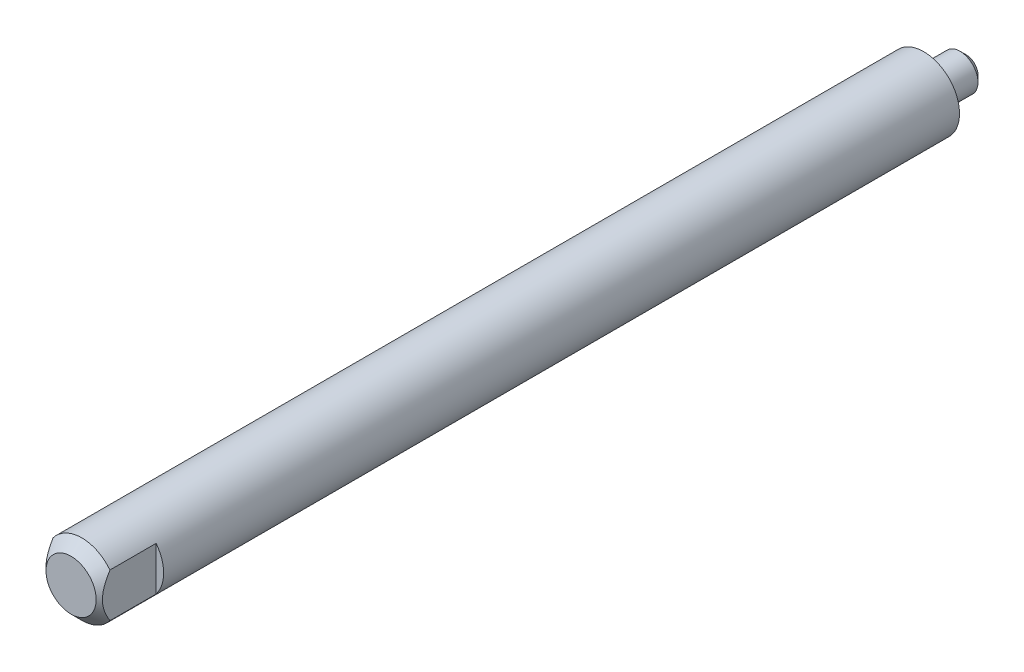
ISO-10303-21;
HEADER;
FILE_DESCRIPTION(('STEP AP214'),'2;1');
FILE_NAME('part.step','',(''),(''),'','','');
FILE_SCHEMA(('AUTOMOTIVE_DESIGN { 1 0 10303 214 1 1 1 1 }'));
ENDSEC;
DATA;
#1=APPLICATION_CONTEXT('core data for automotive mechanical design processes');
#2=APPLICATION_PROTOCOL_DEFINITION('international standard','automotive_design',2000,#1);
#3=PRODUCT_CONTEXT('',#1,'mechanical');
#4=PRODUCT('Part','Part','',(#3));
#5=PRODUCT_RELATED_PRODUCT_CATEGORY('part','',(#4));
#6=PRODUCT_DEFINITION_FORMATION('','',#4);
#7=PRODUCT_DEFINITION_CONTEXT('part definition',#1,'design');
#8=PRODUCT_DEFINITION('design','',#6,#7);
#9=PRODUCT_DEFINITION_SHAPE('','',#8);
#10=(LENGTH_UNIT() NAMED_UNIT(*) SI_UNIT(.MILLI.,.METRE.));
#11=(NAMED_UNIT(*) PLANE_ANGLE_UNIT() SI_UNIT($,.RADIAN.));
#12=(NAMED_UNIT(*) SI_UNIT($,.STERADIAN.) SOLID_ANGLE_UNIT());
#13=UNCERTAINTY_MEASURE_WITH_UNIT(LENGTH_MEASURE(1.E-05),#10,'distance_accuracy_value','');
#14=(GEOMETRIC_REPRESENTATION_CONTEXT(3) GLOBAL_UNCERTAINTY_ASSIGNED_CONTEXT((#13)) GLOBAL_UNIT_ASSIGNED_CONTEXT((#10,
#11,#12)) REPRESENTATION_CONTEXT('',''));
#15=CARTESIAN_POINT('',(0.,0.,0.));
#16=DIRECTION('',(0.,0.,1.));
#17=DIRECTION('',(1.,0.,0.));
#18=AXIS2_PLACEMENT_3D('',#15,#16,#17);
#19=CARTESIAN_POINT('',(0.0303893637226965,0.,120.));
#20=DIRECTION('',(0.,0.,-1.));
#21=DIRECTION('',(0.,-1.,0.));
#22=AXIS2_PLACEMENT_3D('',#19,#20,#21);
#23=CONICAL_SURFACE('',#22,3.5303893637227,0.78539816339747);
#24=CARTESIAN_POINT('',(0.0303893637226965,0.,120.));
#25=DIRECTION('',(0.,0.,-1.));
#26=DIRECTION('',(0.,-1.,0.));
#27=AXIS2_PLACEMENT_3D('',#24,#25,#26);
#28=CIRCLE('',#27,3.5303893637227);
#29=CARTESIAN_POINT('',(0.0303893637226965,-3.5303893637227,120.));
#30=VERTEX_POINT('',#29);
#31=EDGE_CURVE('E112',#30,#30,#28,.T.);
#32=ORIENTED_EDGE('',*,*,#31,.T.);
#33=EDGE_LOOP('',(#32));
#34=FACE_BOUND('',#33,.T.);
#35=CARTESIAN_POINT('',(4.,7.33813034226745,115.187370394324));
#36=CARTESIAN_POINT('',(4.,7.16528585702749,115.339369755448));
#37=CARTESIAN_POINT('',(4.,6.99186027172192,115.490715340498));
#38=CARTESIAN_POINT('',(4.,6.64353602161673,115.791747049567));
#39=CARTESIAN_POINT('',(4.,6.46863716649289,115.94143295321));
#40=CARTESIAN_POINT('',(4.,6.11613508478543,116.239570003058));
#41=CARTESIAN_POINT('',(4.,5.93852227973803,116.388009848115));
#42=CARTESIAN_POINT('',(4.,5.5811516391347,116.682267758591));
#43=CARTESIAN_POINT('',(4.,5.40139393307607,116.82808598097));
#44=CARTESIAN_POINT('',(4.,5.02624820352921,117.126705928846));
#45=CARTESIAN_POINT('',(4.,4.83066252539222,117.279260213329));
#46=CARTESIAN_POINT('',(4.,4.4355616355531,117.579299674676));
#47=CARTESIAN_POINT('',(4.,4.23604568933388,117.726783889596));
#48=CARTESIAN_POINT('',(4.,3.83248423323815,118.014436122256));
#49=CARTESIAN_POINT('',(4.,3.62845042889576,118.15462046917));
#50=CARTESIAN_POINT('',(4.,3.21402508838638,118.425189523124));
#51=CARTESIAN_POINT('',(4.,3.00363658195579,118.555578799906));
#52=CARTESIAN_POINT('',(4.,2.64334730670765,118.762693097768));
#53=CARTESIAN_POINT('',(4.,2.4956507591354,118.843232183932));
#54=CARTESIAN_POINT('',(4.,2.19580765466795,118.995777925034));
#55=CARTESIAN_POINT('',(4.,2.04365981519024,119.067782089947));
#56=CARTESIAN_POINT('',(4.,1.73620810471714,119.199895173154));
#57=CARTESIAN_POINT('',(4.,1.58095751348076,119.2601264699));
#58=CARTESIAN_POINT('',(4.,1.26569016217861,119.366517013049));
#59=CARTESIAN_POINT('',(4.,1.10567636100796,119.412684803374));
#60=CARTESIAN_POINT('',(4.,0.827710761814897,119.476973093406));
#61=CARTESIAN_POINT('',(4.,0.710741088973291,119.499336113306));
#62=CARTESIAN_POINT('',(4.,0.475325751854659,119.534114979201));
#63=CARTESIAN_POINT('',(4.,0.356880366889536,119.546532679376));
#64=CARTESIAN_POINT('',(4.,0.119558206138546,119.5607419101));
#65=CARTESIAN_POINT('',(4.,0.000682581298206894,119.562552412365));
#66=CARTESIAN_POINT('',(4.,-0.236754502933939,119.55549603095));
#67=CARTESIAN_POINT('',(4.,-0.35531594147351,119.546628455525));
#68=CARTESIAN_POINT('',(4.,-0.590194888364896,119.518825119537));
#69=CARTESIAN_POINT('',(4.,-0.706522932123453,119.499976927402));
#70=CARTESIAN_POINT('',(4.,-0.937319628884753,119.453184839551));
#71=CARTESIAN_POINT('',(4.,-1.05178812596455,119.425240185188));
#72=CARTESIAN_POINT('',(4.,-1.27960221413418,119.361083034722));
#73=CARTESIAN_POINT('',(4.,-1.39292493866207,119.32479022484));
#74=CARTESIAN_POINT('',(4.,-1.61707609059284,119.245326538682));
#75=CARTESIAN_POINT('',(4.,-1.727905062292,119.202157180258));
#76=CARTESIAN_POINT('',(4.,-2.01082785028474,119.083315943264));
#77=CARTESIAN_POINT('',(4.,-2.18110670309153,119.003331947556));
#78=CARTESIAN_POINT('',(4.,-2.51626466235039,118.832668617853));
#79=CARTESIAN_POINT('',(4.,-2.68113979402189,118.741981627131));
#80=CARTESIAN_POINT('',(4.,-3.00688630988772,118.552279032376));
#81=CARTESIAN_POINT('',(4.,-3.16773873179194,118.453231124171));
#82=CARTESIAN_POINT('',(4.,-3.48549889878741,118.24913047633));
#83=CARTESIAN_POINT('',(4.,-3.64240766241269,118.144079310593));
#84=CARTESIAN_POINT('',(4.,-3.94420672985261,117.935446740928));
#85=CARTESIAN_POINT('',(4.,-4.08927393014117,117.832119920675));
#86=CARTESIAN_POINT('',(4.,-4.3770427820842,117.622205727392));
#87=CARTESIAN_POINT('',(4.,-4.51974421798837,117.515618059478));
#88=CARTESIAN_POINT('',(4.,-4.80180621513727,117.300874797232));
#89=CARTESIAN_POINT('',(4.,-4.94118567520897,117.192743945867));
#90=CARTESIAN_POINT('',(4.,-5.21825792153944,116.974411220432));
#91=CARTESIAN_POINT('',(4.,-5.35595112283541,116.864209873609));
#92=CARTESIAN_POINT('',(4.,-5.49296670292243,116.753185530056));
#93=B_SPLINE_CURVE_WITH_KNOTS('',3,(#35,#36,#37,#38,#39,#40,#41,#42,#43,#44,#45,#46,#47,#48,#49,
#50,#51,#52,#53,#54,#55,#56,#57,#58,#59,#60,#61,#62,#63,#64,#65,#66,#67,#68,#69,#70,#71,#72,#73,
#74,#75,#76,#77,#78,#79,#80,#81,#82,#83,#84,#85,#86,#87,#88,#89,#90,#91,#92),.UNSPECIFIED.,.F.,
.F.,(4,2,2,2,2,2,2,2,2,2,2,2,2,2,2,2,2,2,2,2,2,2,2,2,2,2,2,2,4),(0.,0.690520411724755,
1.38113143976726,2.0755365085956,2.76989986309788,3.51397533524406,4.25819121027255,
5.00066372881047,5.74278767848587,6.24726681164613,6.75189276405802,7.25095592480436,
7.74971528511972,8.10660603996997,8.46343024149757,8.8196160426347,9.17582491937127,
9.52895903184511,9.88212260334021,10.2388375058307,10.5954737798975,11.1593067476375,
11.7235455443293,12.2900740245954,12.8564546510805,13.3907111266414,13.9250160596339,
14.4542112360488,14.9832734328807),.UNSPECIFIED.);
#94=CARTESIAN_POINT('',(4.,3.08982338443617,118.5));
#95=VERTEX_POINT('',#94);
#96=CARTESIAN_POINT('',(4.,-3.08982338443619,118.5));
#97=VERTEX_POINT('',#96);
#98=EDGE_CURVE('E64',#95,#97,#93,.T.);
#99=ORIENTED_EDGE('',*,*,#98,.F.);
#100=CARTESIAN_POINT('',(0.0303893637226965,0.,118.5));
#101=DIRECTION('',(0.,0.,-1.));
#102=DIRECTION('',(0.,-1.,0.));
#103=AXIS2_PLACEMENT_3D('',#100,#101,#102);
#104=CIRCLE('',#103,5.03038936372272);
#105=CARTESIAN_POINT('',(-4.,3.01011274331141,118.5));
#106=VERTEX_POINT('',#105);
#107=EDGE_CURVE('E110',#106,#95,#104,.T.);
#108=ORIENTED_EDGE('',*,*,#107,.F.);
#109=CARTESIAN_POINT('',(-4.,7.36644510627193,115.133452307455));
#110=CARTESIAN_POINT('',(-4.,7.19226264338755,115.286231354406));
#111=CARTESIAN_POINT('',(-4.,7.01748363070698,115.438337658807));
#112=CARTESIAN_POINT('',(-4.,6.66641297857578,115.740842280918));
#113=CARTESIAN_POINT('',(-4.,6.49012113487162,115.891240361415));
#114=CARTESIAN_POINT('',(-4.,6.13472807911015,116.19078770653));
#115=CARTESIAN_POINT('',(-4.,5.95561651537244,116.339924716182));
#116=CARTESIAN_POINT('',(-4.,5.59519131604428,116.635495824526));
#117=CARTESIAN_POINT('',(-4.,5.41387781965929,116.781930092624));
#118=CARTESIAN_POINT('',(-4.,5.03480962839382,117.082214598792));
#119=CARTESIAN_POINT('',(-4.,4.83684199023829,117.235796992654));
#120=CARTESIAN_POINT('',(-4.,4.43684562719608,117.537694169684));
#121=CARTESIAN_POINT('',(-4.,4.23481609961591,117.686007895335));
#122=CARTESIAN_POINT('',(-4.,3.82609576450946,117.975014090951));
#123=CARTESIAN_POINT('',(-4.,3.61941770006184,118.115724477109));
#124=CARTESIAN_POINT('',(-4.,3.19950883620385,118.386933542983));
#125=CARTESIAN_POINT('',(-4.,2.98628134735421,118.517437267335));
#126=CARTESIAN_POINT('',(-4.,2.62183643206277,118.723784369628));
#127=CARTESIAN_POINT('',(-4.,2.47290359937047,118.803641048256));
#128=CARTESIAN_POINT('',(-4.,2.1705438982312,118.954570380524));
#129=CARTESIAN_POINT('',(-4.,2.01711577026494,119.025640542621));
#130=CARTESIAN_POINT('',(-4.,1.70721835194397,119.155565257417));
#131=CARTESIAN_POINT('',(-4.,1.55080567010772,119.214553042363));
#132=CARTESIAN_POINT('',(-4.,1.23328290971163,119.318195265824));
#133=CARTESIAN_POINT('',(-4.,1.0721756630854,119.362858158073));
#134=CARTESIAN_POINT('',(-4.,0.791167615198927,119.424694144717));
#135=CARTESIAN_POINT('',(-4.,0.672188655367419,119.446053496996));
#136=CARTESIAN_POINT('',(-4.,0.432841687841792,119.478556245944));
#137=CARTESIAN_POINT('',(-4.,0.312473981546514,119.48970181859));
#138=CARTESIAN_POINT('',(-4.,0.0714376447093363,119.501161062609));
#139=CARTESIAN_POINT('',(-4.,-0.0492300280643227,119.501494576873));
#140=CARTESIAN_POINT('',(-4.,-0.29011968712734,119.491365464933));
#141=CARTESIAN_POINT('',(-4.,-0.410341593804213,119.480900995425));
#142=CARTESIAN_POINT('',(-4.,-0.67461367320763,119.446448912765));
#143=CARTESIAN_POINT('',(-4.,-0.818353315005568,119.420078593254));
#144=CARTESIAN_POINT('',(-4.,-1.10275410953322,119.354156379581));
#145=CARTESIAN_POINT('',(-4.,-1.24341419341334,119.314599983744));
#146=CARTESIAN_POINT('',(-4.,-1.52331578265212,119.22379975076));
#147=CARTESIAN_POINT('',(-4.,-1.66250017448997,119.172381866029));
#148=CARTESIAN_POINT('',(-4.,-1.86841050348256,119.088422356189));
#149=CARTESIAN_POINT('',(-4.,-1.93656399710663,119.059299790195));
#150=CARTESIAN_POINT('',(-4.,-2.071958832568,118.999012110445));
#151=CARTESIAN_POINT('',(-4.,-2.1392002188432,118.967847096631));
#152=CARTESIAN_POINT('',(-4.,-2.34827872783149,118.867466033));
#153=CARTESIAN_POINT('',(-4.,-2.48857663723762,118.7950351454));
#154=CARTESIAN_POINT('',(-4.,-2.76567007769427,118.643723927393));
#155=CARTESIAN_POINT('',(-4.,-2.90246437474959,118.564841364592));
#156=CARTESIAN_POINT('',(-4.,-3.17316533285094,118.401907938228));
#157=CARTESIAN_POINT('',(-4.,-3.30706804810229,118.317850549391));
#158=CARTESIAN_POINT('',(-4.,-3.57222979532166,118.145716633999));
#159=CARTESIAN_POINT('',(-4.,-3.70348912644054,118.057640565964));
#160=CARTESIAN_POINT('',(-4.,-3.96459211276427,117.877688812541));
#161=CARTESIAN_POINT('',(-4.,-4.09442162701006,117.785792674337));
#162=CARTESIAN_POINT('',(-4.,-4.35215592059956,117.599335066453));
#163=CARTESIAN_POINT('',(-4.,-4.48006060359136,117.504773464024));
#164=CARTESIAN_POINT('',(-4.,-4.86113990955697,117.217972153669));
#165=CARTESIAN_POINT('',(-4.,-5.11186891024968,117.022483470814));
#166=CARTESIAN_POINT('',(-4.,-5.57982109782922,116.648446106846));
#167=CARTESIAN_POINT('',(-4.,-5.79756949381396,116.470548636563));
#168=CARTESIAN_POINT('',(-4.,-6.23016750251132,116.111189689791));
#169=CARTESIAN_POINT('',(-4.,-6.44501659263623,115.929727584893));
#170=CARTESIAN_POINT('',(-4.,-6.86957325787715,115.566525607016));
#171=CARTESIAN_POINT('',(-4.,-7.07931124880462,115.384821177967));
#172=CARTESIAN_POINT('',(-4.,-7.49689745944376,115.019366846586));
#173=CARTESIAN_POINT('',(-4.,-7.70474618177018,114.835617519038));
#174=CARTESIAN_POINT('',(-4.,-7.91188936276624,114.651085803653));
#175=B_SPLINE_CURVE_WITH_KNOTS('',3,(#109,#110,#111,#112,#113,#114,#115,#116,#117,#118,#119,
#120,#121,#122,#123,#124,#125,#126,#127,#128,#129,#130,#131,#132,#133,#134,#135,#136,#137,#138,
#139,#140,#141,#142,#143,#144,#145,#146,#147,#148,#149,#150,#151,#152,#153,#154,#155,#156,#157,
#158,#159,#160,#161,#162,#163,#164,#165,#166,#167,#168,#169,#170,#171,#172,#173,#174),
.UNSPECIFIED.,.F.,.F.,(4,2,2,2,2,2,2,2,2,2,2,2,2,2,2,2,2,2,2,2,2,2,2,2,2,2,2,2,2,2,2,2,4),(0.,
0.695080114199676,1.39025559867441,2.08945204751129,2.78860452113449,3.5402102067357,
4.29196591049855,5.04186515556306,5.79139139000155,6.29814904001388,6.80505006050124,
7.30601849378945,7.80669073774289,8.16894371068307,8.53111949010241,8.89263054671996,
9.25420332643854,9.69187797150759,10.1297021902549,10.5744130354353,10.7967313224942,
11.0190387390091,11.4924726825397,11.9660711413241,12.4402795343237,12.9144339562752,
13.3915774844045,13.8687448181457,14.8223871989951,15.6658868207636,16.5095365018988,
17.342023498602,18.174282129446),.UNSPECIFIED.);
#176=CARTESIAN_POINT('',(-4.,-3.01011274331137,118.5));
#177=VERTEX_POINT('',#176);
#178=EDGE_CURVE('E88',#177,#106,#175,.F.);
#179=ORIENTED_EDGE('',*,*,#178,.F.);
#180=EDGE_CURVE('E109',#97,#177,#104,.T.);
#181=ORIENTED_EDGE('',*,*,#180,.F.);
#182=EDGE_LOOP('',(#99,#108,#179,#181));
#183=FACE_BOUND('',#182,.T.);
#184=ADVANCED_FACE('F14',(#34,#183),#23,.T.);
#185=CARTESIAN_POINT('',(0.0303893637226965,0.,-8.08262108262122));
#186=DIRECTION('',(0.,0.,-1.));
#187=DIRECTION('',(0.,-1.,0.));
#188=AXIS2_PLACEMENT_3D('',#185,#186,#187);
#189=CYLINDRICAL_SURFACE('',#188,5.03038936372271);
#190=CARTESIAN_POINT('',(0.0303893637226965,0.,0.));
#191=DIRECTION('',(0.,0.,-1.));
#192=DIRECTION('',(0.,-1.,0.));
#193=AXIS2_PLACEMENT_3D('',#190,#191,#192);
#194=CIRCLE('',#193,5.03038936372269);
#195=CARTESIAN_POINT('',(0.0303893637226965,-5.03038936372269,0.));
#196=VERTEX_POINT('',#195);
#197=EDGE_CURVE('E106',#196,#196,#194,.T.);
#198=ORIENTED_EDGE('',*,*,#197,.F.);
#199=EDGE_LOOP('',(#198));
#200=FACE_BOUND('',#199,.T.);
#201=CARTESIAN_POINT('',(0.0303893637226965,0.,112.));
#202=DIRECTION('',(0.,0.,-1.));
#203=DIRECTION('',(0.,-1.,0.));
#204=AXIS2_PLACEMENT_3D('',#201,#202,#203);
#205=CIRCLE('',#204,5.03038936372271);
#206=CARTESIAN_POINT('',(4.,3.08982338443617,112.));
#207=VERTEX_POINT('',#206);
#208=CARTESIAN_POINT('',(4.,-3.08982338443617,112.));
#209=VERTEX_POINT('',#208);
#210=EDGE_CURVE('E22',#207,#209,#205,.T.);
#211=ORIENTED_EDGE('',*,*,#210,.T.);
#212=DIRECTION('',(0.,0.,-1.));
#213=VECTOR('',#212,1.);
#214=CARTESIAN_POINT('',(4.,-3.08982338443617,-8.08262108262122));
#215=LINE('',#214,#213);
#216=EDGE_CURVE('E9',#97,#209,#215,.T.);
#217=ORIENTED_EDGE('',*,*,#216,.F.);
#218=ORIENTED_EDGE('',*,*,#180,.T.);
#219=DIRECTION('',(0.,0.,-1.));
#220=VECTOR('',#219,1.);
#221=CARTESIAN_POINT('',(-4.,-3.01011274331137,-8.08262108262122));
#222=LINE('',#221,#220);
#223=CARTESIAN_POINT('',(-4.,-3.01011274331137,112.));
#224=VERTEX_POINT('',#223);
#225=EDGE_CURVE('E115',#224,#177,#222,.F.);
#226=ORIENTED_EDGE('',*,*,#225,.F.);
#227=CARTESIAN_POINT('',(0.0303893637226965,0.,112.));
#228=DIRECTION('',(0.,0.,1.));
#229=DIRECTION('',(0.,1.,0.));
#230=AXIS2_PLACEMENT_3D('',#227,#228,#229);
#231=CIRCLE('',#230,5.03038936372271);
#232=CARTESIAN_POINT('',(-4.,3.01011274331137,112.));
#233=VERTEX_POINT('',#232);
#234=EDGE_CURVE('E117',#233,#224,#231,.T.);
#235=ORIENTED_EDGE('',*,*,#234,.F.);
#236=DIRECTION('',(0.,0.,-1.));
#237=VECTOR('',#236,1.);
#238=CARTESIAN_POINT('',(-4.,3.01011274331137,-8.08262108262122));
#239=LINE('',#238,#237);
#240=EDGE_CURVE('E119',#106,#233,#239,.T.);
#241=ORIENTED_EDGE('',*,*,#240,.F.);
#242=ORIENTED_EDGE('',*,*,#107,.T.);
#243=DIRECTION('',(0.,0.,-1.));
#244=VECTOR('',#243,1.);
#245=CARTESIAN_POINT('',(4.,3.08982338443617,-8.08262108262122));
#246=LINE('',#245,#244);
#247=EDGE_CURVE('E60',#207,#95,#246,.F.);
#248=ORIENTED_EDGE('',*,*,#247,.F.);
#249=EDGE_LOOP('',(#211,#217,#218,#226,#235,#241,#242,#248));
#250=FACE_BOUND('',#249,.T.);
#251=ADVANCED_FACE('F57',(#200,#250),#189,.T.);
#252=CARTESIAN_POINT('',(-3.5,0.,120.));
#253=DIRECTION('',(0.,0.,-1.));
#254=DIRECTION('',(0.,-1.,0.));
#255=AXIS2_PLACEMENT_3D('',#252,#253,#254);
#256=PLANE('',#255);
#257=ORIENTED_EDGE('',*,*,#31,.F.);
#258=EDGE_LOOP('',(#257));
#259=FACE_BOUND('',#258,.T.);
#260=ADVANCED_FACE('F16',(#259),#256,.F.);
#261=CARTESIAN_POINT('',(-2.79999999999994,0.,0.));
#262=DIRECTION('',(0.,0.,1.));
#263=DIRECTION('',(0.,1.,0.));
#264=AXIS2_PLACEMENT_3D('',#261,#262,#263);
#265=PLANE('',#264);
#266=CARTESIAN_POINT('',(0.0303893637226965,0.,0.));
#267=DIRECTION('',(0.,0.,-1.));
#268=DIRECTION('',(0.,-1.,0.));
#269=AXIS2_PLACEMENT_3D('',#266,#267,#268);
#270=CIRCLE('',#269,2.83038936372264);
#271=CARTESIAN_POINT('',(0.0303893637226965,-2.83038936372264,0.));
#272=VERTEX_POINT('',#271);
#273=EDGE_CURVE('E103',#272,#272,#270,.T.);
#274=ORIENTED_EDGE('',*,*,#273,.F.);
#275=EDGE_LOOP('',(#274));
#276=FACE_BOUND('',#275,.T.);
#277=ORIENTED_EDGE('',*,*,#197,.T.);
#278=EDGE_LOOP('',(#277));
#279=FACE_BOUND('',#278,.T.);
#280=ADVANCED_FACE('F146',(#276,#279),#265,.F.);
#281=CARTESIAN_POINT('',(0.0303893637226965,0.,-0.300000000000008));
#282=DIRECTION('',(0.,0.,-1.));
#283=DIRECTION('',(0.,-1.,0.));
#284=AXIS2_PLACEMENT_3D('',#281,#282,#283);
#285=TOROIDAL_SURFACE('',#284,2.83038936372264,0.299999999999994);
#286=CARTESIAN_POINT('',(0.0303893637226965,0.,-0.300000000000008));
#287=DIRECTION('',(0.,0.,-1.));
#288=DIRECTION('',(0.,-1.,0.));
#289=AXIS2_PLACEMENT_3D('',#286,#287,#288);
#290=CIRCLE('',#289,2.53038936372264);
#291=CARTESIAN_POINT('',(0.0303893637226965,-2.53038936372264,-0.300000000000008));
#292=VERTEX_POINT('',#291);
#293=EDGE_CURVE('E100',#292,#292,#290,.T.);
#294=ORIENTED_EDGE('',*,*,#293,.F.);
#295=EDGE_LOOP('',(#294));
#296=FACE_BOUND('',#295,.T.);
#297=ORIENTED_EDGE('',*,*,#273,.T.);
#298=EDGE_LOOP('',(#297));
#299=FACE_BOUND('',#298,.T.);
#300=ADVANCED_FACE('F151',(#296,#299),#285,.F.);
#301=CARTESIAN_POINT('',(0.0303893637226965,0.,-8.08262108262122));
#302=DIRECTION('',(0.,0.,-1.));
#303=DIRECTION('',(0.,-1.,0.));
#304=AXIS2_PLACEMENT_3D('',#301,#302,#303);
#305=CYLINDRICAL_SURFACE('',#304,2.53038936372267);
#306=CARTESIAN_POINT('',(0.0303893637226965,0.,-5.10000000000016));
#307=DIRECTION('',(0.,0.,-1.));
#308=DIRECTION('',(0.,-1.,0.));
#309=AXIS2_PLACEMENT_3D('',#306,#307,#308);
#310=CIRCLE('',#309,2.5303893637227);
#311=CARTESIAN_POINT('',(0.0303893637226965,-2.5303893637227,-5.10000000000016));
#312=VERTEX_POINT('',#311);
#313=EDGE_CURVE('E97',#312,#312,#310,.T.);
#314=ORIENTED_EDGE('',*,*,#313,.F.);
#315=EDGE_LOOP('',(#314));
#316=FACE_BOUND('',#315,.T.);
#317=ORIENTED_EDGE('',*,*,#293,.T.);
#318=EDGE_LOOP('',(#317));
#319=FACE_BOUND('',#318,.T.);
#320=ADVANCED_FACE('F158',(#316,#319),#305,.T.);
#321=CARTESIAN_POINT('',(0.0303893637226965,0.,-5.10000000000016));
#322=DIRECTION('',(0.,0.,1.));
#323=DIRECTION('',(0.,1.,0.));
#324=AXIS2_PLACEMENT_3D('',#321,#322,#323);
#325=CONICAL_SURFACE('',#324,2.5303893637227,0.785398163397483);
#326=CARTESIAN_POINT('',(0.0303893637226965,0.,-6.00000000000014));
#327=DIRECTION('',(0.,0.,-1.));
#328=DIRECTION('',(0.,-1.,0.));
#329=AXIS2_PLACEMENT_3D('',#326,#327,#328);
#330=CIRCLE('',#329,1.63038936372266);
#331=CARTESIAN_POINT('',(0.0303893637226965,-1.63038936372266,-6.00000000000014));
#332=VERTEX_POINT('',#331);
#333=EDGE_CURVE('E94',#332,#332,#330,.T.);
#334=ORIENTED_EDGE('',*,*,#333,.F.);
#335=EDGE_LOOP('',(#334));
#336=FACE_BOUND('',#335,.T.);
#337=ORIENTED_EDGE('',*,*,#313,.T.);
#338=EDGE_LOOP('',(#337));
#339=FACE_BOUND('',#338,.T.);
#340=ADVANCED_FACE('F134',(#336,#339),#325,.T.);
#341=CARTESIAN_POINT('',(0.0303893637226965,0.,-6.00000000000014));
#342=DIRECTION('',(0.,0.,1.));
#343=DIRECTION('',(0.,1.,0.));
#344=AXIS2_PLACEMENT_3D('',#341,#342,#343);
#345=PLANE('',#344);
#346=ORIENTED_EDGE('',*,*,#333,.T.);
#347=EDGE_LOOP('',(#346));
#348=FACE_BOUND('',#347,.T.);
#349=ADVANCED_FACE('F128',(#348),#345,.F.);
#350=CARTESIAN_POINT('',(-5.,-9.,112.));
#351=DIRECTION('',(0.,0.,1.));
#352=DIRECTION('',(0.,1.,0.));
#353=AXIS2_PLACEMENT_3D('',#350,#351,#352);
#354=PLANE('',#353);
#355=DIRECTION('',(0.,-1.,0.));
#356=VECTOR('',#355,1.);
#357=CARTESIAN_POINT('',(-4.,-9.,112.));
#358=LINE('',#357,#356);
#359=EDGE_CURVE('E36',#233,#224,#358,.T.);
#360=ORIENTED_EDGE('',*,*,#359,.F.);
#361=ORIENTED_EDGE('',*,*,#234,.T.);
#362=EDGE_LOOP('',(#360,#361));
#363=FACE_BOUND('',#362,.T.);
#364=ADVANCED_FACE('F86',(#363),#354,.T.);
#365=CARTESIAN_POINT('',(-4.,11.,130.));
#366=DIRECTION('',(-1.,0.,0.));
#367=DIRECTION('',(0.,-1.,0.));
#368=AXIS2_PLACEMENT_3D('',#365,#366,#367);
#369=PLANE('',#368);
#370=ORIENTED_EDGE('',*,*,#240,.T.);
#371=ORIENTED_EDGE('',*,*,#359,.T.);
#372=ORIENTED_EDGE('',*,*,#225,.T.);
#373=ORIENTED_EDGE('',*,*,#178,.T.);
#374=EDGE_LOOP('',(#370,#371,#372,#373));
#375=FACE_BOUND('',#374,.T.);
#376=ADVANCED_FACE('F82',(#375),#369,.T.);
#377=CARTESIAN_POINT('',(5.06077872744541,-9.,112.));
#378=DIRECTION('',(0.,0.,-1.));
#379=DIRECTION('',(0.,-1.,0.));
#380=AXIS2_PLACEMENT_3D('',#377,#378,#379);
#381=PLANE('',#380);
#382=DIRECTION('',(0.,-1.,0.));
#383=VECTOR('',#382,1.);
#384=CARTESIAN_POINT('',(4.,-9.,112.));
#385=LINE('',#384,#383);
#386=EDGE_CURVE('E28',#207,#209,#385,.T.);
#387=ORIENTED_EDGE('',*,*,#386,.T.);
#388=ORIENTED_EDGE('',*,*,#210,.F.);
#389=EDGE_LOOP('',(#387,#388));
#390=FACE_BOUND('',#389,.T.);
#391=ADVANCED_FACE('F65',(#390),#381,.F.);
#392=CARTESIAN_POINT('',(4.,11.,130.));
#393=DIRECTION('',(1.,0.,0.));
#394=DIRECTION('',(0.,-1.,0.));
#395=AXIS2_PLACEMENT_3D('',#392,#393,#394);
#396=PLANE('',#395);
#397=ORIENTED_EDGE('',*,*,#216,.T.);
#398=ORIENTED_EDGE('',*,*,#386,.F.);
#399=ORIENTED_EDGE('',*,*,#247,.T.);
#400=ORIENTED_EDGE('',*,*,#98,.T.);
#401=EDGE_LOOP('',(#397,#398,#399,#400));
#402=FACE_BOUND('',#401,.T.);
#403=ADVANCED_FACE('F62',(#402),#396,.T.);
#404=CLOSED_SHELL('',(#184,#251,#260,#280,#300,#320,#340,#349,#364,#376,#391,#403));
#405=MANIFOLD_SOLID_BREP('B1',#404);
#406=ADVANCED_BREP_SHAPE_REPRESENTATION('',(#18,#405),#14);
#407=SHAPE_DEFINITION_REPRESENTATION(#9,#406);
ENDSEC;
END-ISO-10303-21;
